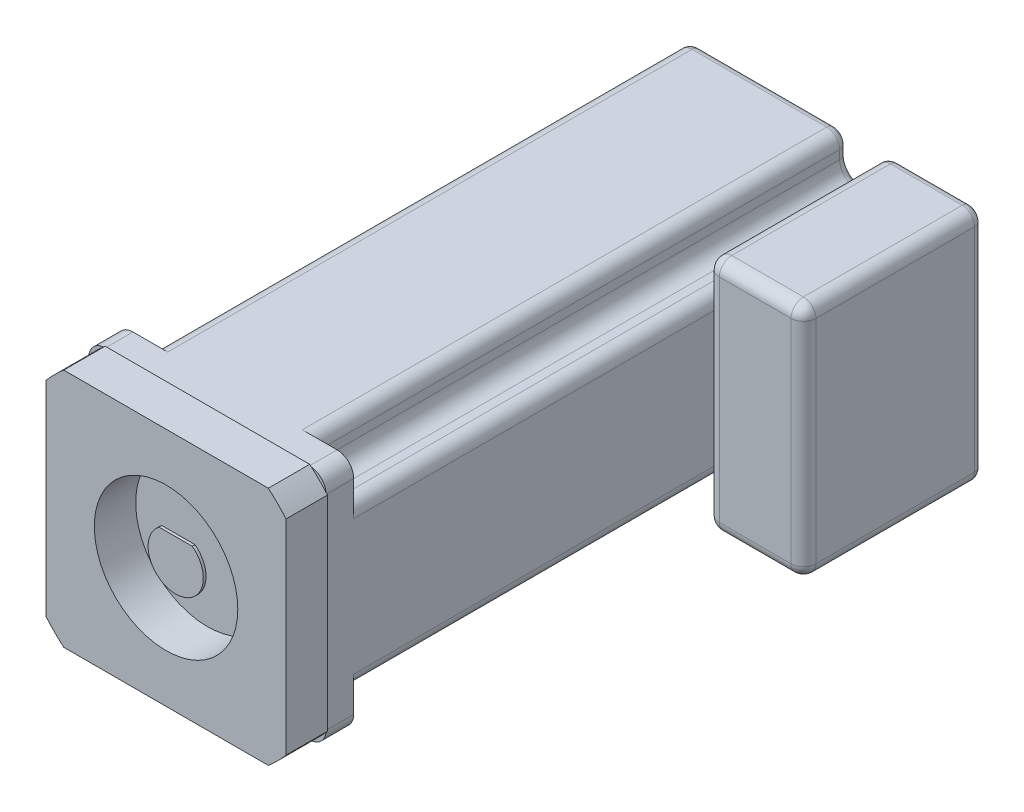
from build123d import *

# Parameters (mm, degrees)
BOSS_EXTRUDE1_DEPTH = 1
BOSS_EXTRUDE2_START = 4.5
SKETCH2_R           = 26
BOSS_EXTRUDE2_DEPTH = 15
SKETCH3_W           = 86
SKETCH3_H           = 86
BOSS_EXTRUDE3_DEPTH = 203
SKETCH4_W           = 13.9
SKETCH4_H           = 13.9
CUT_EXTRUDE1_DEPTH  = 193
FILLET1_R           = 6
FILLET2_R           = 4.7
FILLET3_R           = 3
SKETCH5_W           = 65
SKETCH5_H           = 86
BOSS_EXTRUDE4_DEPTH = 35
FILLET5_R           = 4.5
FILLET7_R           = 3


with BuildPart() as part:
    # Sketch1 → Boss-Extrude1 (new body)
    with BuildSketch(Plane.XY):
        with BuildLine():
            Line((-6, 8), (6, 8))
            ThreePointArc((6, 8), (0, -10), (-6, 8))
        make_face()
    extrude(amount=BOSS_EXTRUDE1_DEPTH)


with BuildPart() as body_2:
    # Sketch2 → Boss-Extrude2 (new body)
    with BuildSketch(Plane.XY.offset(BOSS_EXTRUDE2_START)):
        with BuildLine():
            Line((-37.065786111, 43.5), (37.065786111, 43.5))
            ThreePointArc((37.065786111, 43.5), (40.411152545, 40.411152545), (43.5, 37.065786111))
            Line((43.5, 37.065786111), (43.5, -37.065786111))
            ThreePointArc((43.5, -37.065786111), (40.411152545, -40.411152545), (37.065786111, -43.5))
            Line((37.065786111, -43.5), (-37.065786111, -43.5))
            ThreePointArc((-37.065786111, -43.5), (-40.411152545, -40.411152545), (-43.5, -37.065786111))
            Line((-43.5, -37.065786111), (-43.5, 37.065786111))
            ThreePointArc((-43.5, 37.065786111), (-40.411152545, 40.411152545), (-37.065786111, 43.5))
        make_face()
        Circle(SKETCH2_R, mode=Mode.SUBTRACT)
    extrude(amount=-BOSS_EXTRUDE2_DEPTH)


with BuildPart() as body_3:
    # Sketch3 → Boss-Extrude3 (new body)
    with BuildSketch(Plane(origin=(0, 0, -10.5), x_dir=(-1, 0, 0), z_dir=(0, 0, -1))):
        Rectangle(SKETCH3_W, SKETCH3_H)
    extrude(amount=BOSS_EXTRUDE3_DEPTH)

    # Sketch4 → Cut-Extrude1 (cut)
    with BuildSketch(Plane(origin=(0, 0, -213.5), x_dir=(-1, 0, 0), z_dir=(0, 0, -1))):
        with Locations((-36.05, 36.05)):
            Rectangle(SKETCH4_W, SKETCH4_H)
        with Locations((36.05, 36.05)):
            Rectangle(SKETCH4_W, SKETCH4_H)
        with Locations((36.05, -36.05)):
            Rectangle(SKETCH4_W, SKETCH4_H)
        with Locations((-36.05, -36.05)):
            Rectangle(SKETCH4_W, SKETCH4_H)
    extrude(amount=-CUT_EXTRUDE1_DEPTH, mode=Mode.SUBTRACT)

    # Fillet1
    fillet1_edges = [body_3.edges().sort_by_distance(p)[0] for p in [
        (43, 43, -15.5),
        (29.1, 29.1, -117),
        (-43, 43, -15.5),
        (-29.1, 29.1, -117),
        (-43, -43, -15.5),
        (-29.1, -29.1, -117),
        (43, -43, -15.5),
        (29.1, -29.1, -117),
    ]]
    fillet(fillet1_edges, radius=FILLET1_R)

    # Fillet2
    fillet2_edges = [body_3.edges().sort_by_distance(p)[0] for p in [
        (29.1, 43, -117),
        (43, 29.1, -117),
        (-29.1, 43, -117),
        (-43, 29.1, -117),
        (-29.1, -43, -117),
        (-43, -29.1, -117),
        (29.1, -43, -117),
        (43, -29.1, -117),
    ]]
    fillet(fillet2_edges, radius=FILLET2_R)

    # Fillet3
    fillet3_edges = [body_3.edges().sort_by_distance(p)[0] for p in [
        (29.1, -36.7, -213.5),
        (0, -43, -213.5),
        (-36.7, -29.1, -213.5),
        (-43, 0, -213.5),
        (-29.1, 36.7, -213.5),
        (0, 43, -213.5),
        (36.7, 29.1, -213.5),
        (43, 0, -213.5),
        (-27.723401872, -41.623401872, -213.5),
        (-41.623401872, -27.723401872, -213.5),
        (-41.623401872, 27.723401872, -213.5),
        (-27.723401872, 41.623401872, -213.5),
        (27.723401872, 41.623401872, -213.5),
        (41.623401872, 27.723401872, -213.5),
        (41.623401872, -27.723401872, -213.5),
        (27.723401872, -41.623401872, -213.5),
        (-36.7, 29.1, -213.5),
        (-29.1, -36.7, -213.5),
        (36.7, -29.1, -213.5),
        (29.1, 36.7, -213.5),
        (-30.857359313, 30.857359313, -213.5),
        (-30.857359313, -30.857359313, -213.5),
        (30.857359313, -30.857359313, -213.5),
        (30.857359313, 30.857359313, -213.5),
    ]]
    fillet(fillet3_edges, radius=FILLET3_R)


with BuildPart() as body_4:
    # Sketch5 → Boss-Extrude4 (new body)
    with BuildSketch(Plane(origin=(43, 0, 0), x_dir=(0, 0, -1), z_dir=(1, 0, 0))):
        with Locations((181, 0)):
            Rectangle(SKETCH5_W, SKETCH5_H)
    extrude(amount=BOSS_EXTRUDE4_DEPTH)

    # Fillet5
    fillet5_edges = [body_4.edges().sort_by_distance(p)[0] for p in [
        (78, 43, -181),
        (78, 0, -148.5),
        (43, 43, -181),
        (43, -43, -181),
        (43, 0, -148.5),
        (78, -43, -181),
        (60.5, 43, -148.5),
        (60.5, -43, -148.5),
    ]]
    fillet(fillet5_edges, radius=FILLET5_R)

    # Fillet7
    fillet7_edges = [body_4.edges().sort_by_distance(p)[0] for p in [
        (78, 0, -213.5),
        (60.5, 43, -213.5),
        (43, 0, -213.5),
        (60.5, -43, -213.5),
        (76.681980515, -41.681980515, -213.5),
        (44.318019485, -41.681980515, -213.5),
        (44.318019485, 41.681980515, -213.5),
        (76.681980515, 41.681980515, -213.5),
    ]]
    fillet(fillet7_edges, radius=FILLET7_R)


solid = Compound([part.part, body_2.part, body_3.part, body_4.part])
